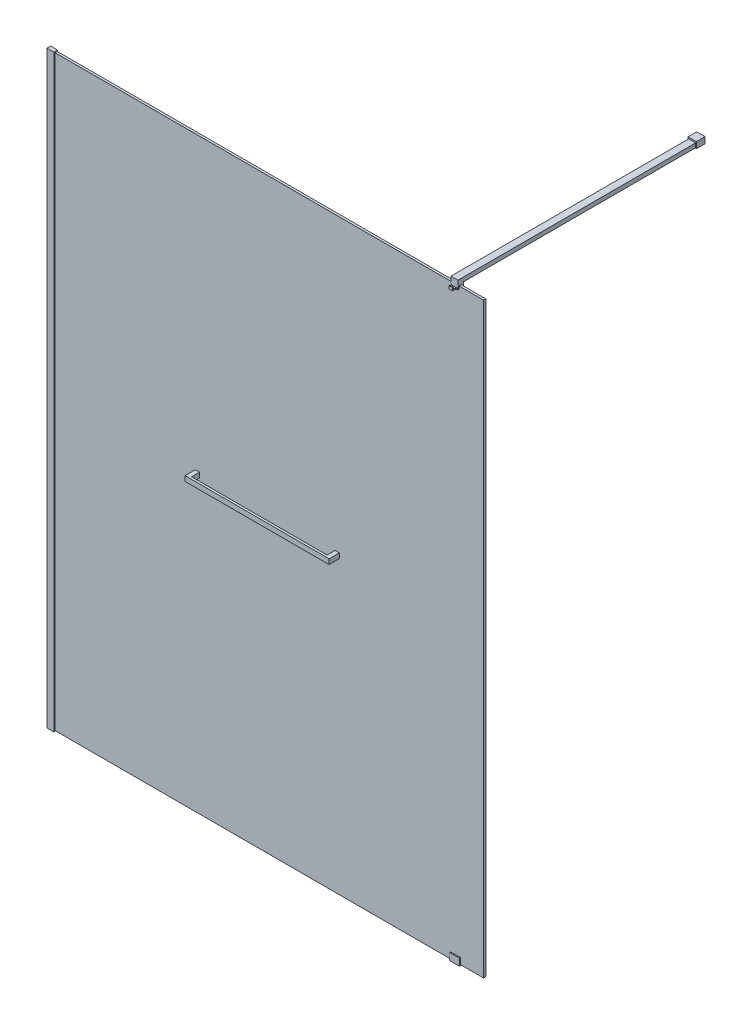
from build123d import *

# Parameters (mm, degrees)
DODANIE_WYCI_GNI_CIE1_DEPTH     = 2100
SZKIC2_W                        = 1547
SZKIC2_H                        = 8
DODANIE_WYCI_GNI_CIE2_DEPTH     = 2100
SZKIC4_W                        = 25
SZKIC4_H                        = 13.3
DODANIE_WYCI_GNI_CIE3_DEPTH     = 3
SZKIC5_W                        = 25
SZKIC5_H                        = 13.3
DODANIE_WYCI_GNI_CIE4_DEPTH     = 3
DODANIE_WYCI_GNI_CIE5_DEPTH     = 17.5
DODANIE_WYCI_GNI_CIE6_DEPTH     = 12.5
WYTNIJ_WYCI_GNI_CIE1_DEPTH      = 2618.585101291
WYTNIJ_WYCI_GNI_CIE1_DEPTH_BACK = 2618.585101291
SZKIC10_W                       = 25
SZKIC10_H                       = 861.63
DODANIE_WYCI_GNI_CIE7_DEPTH     = 15
SZKIC14_W                       = 30
SZKIC14_H                       = 22
DODANIE_WYCI_GNI_CIE8_DEPTH     = 31
POLKA_1A_DEPTH                  = 36.5
POLKA_1A_DEPTH_BACK             = 31
SZKIC17_W                       = 15
SZKIC17_H                       = 18
POLKA_1A_2_DEPTH                = 36.5
POLKA_1A_2_DEPTH_BACK           = 31
POLKA_1B_START                  = -515
SZKIC18_W                       = 12.8
SZKIC18_H                       = 8
POLKA_1B_DEPTH                  = 515
POLKA_1C_START                  = -5.28
SZKIC19_W                       = 515
SZKIC19_H                       = 80
POLKA_1C_DEPTH                  = 8
SZKIC20_W                       = 8
SZKIC20_H                       = 18
POLKA_1D_DEPTH                  = 485


with BuildPart() as part:
    # Szkic1 → Dodanie-wyci_gni_cie1 (new body)
    with BuildSketch(Plane(origin=(0, 0, 0), x_dir=(1, 0, 0), z_dir=(0, 1, 0))):
        Polygon((0, 0), (0, 13.3), (25, 13.3), (25, 11.4), (11.45, 11.4), (11.45, 3.4), (25, 3.4), (25, 0), align=None)
    extrude(amount=DODANIE_WYCI_GNI_CIE1_DEPTH)

    # Szkic4 → Dodanie-wyci_gni_cie3 (add)
    with BuildSketch(Plane(origin=(0, 2100, 0), x_dir=(1, 0, 0), z_dir=(0, 1, 0))):
        with Locations((12.5, 6.65)):
            Rectangle(SZKIC4_W, SZKIC4_H)
    extrude(amount=DODANIE_WYCI_GNI_CIE3_DEPTH)

    # Szkic5 → Dodanie-wyci_gni_cie4 (add)
    with BuildSketch(Plane.XZ):
        with Locations((12.5, -6.65)):
            Rectangle(SZKIC5_W, SZKIC5_H)
    extrude(amount=DODANIE_WYCI_GNI_CIE4_DEPTH)


with BuildPart() as body_2:
    # Szkic2 → Dodanie-wyci_gni_cie2 (new body)
    with BuildSketch(Plane.XZ):
        with Locations((784.95, -7.4)):
            Rectangle(SZKIC2_W, SZKIC2_H)
    extrude(amount=-DODANIE_WYCI_GNI_CIE2_DEPTH)


with BuildPart() as body_3:
    # Szkic6 → Dodanie-wyci_gni_cie5 (new, symmetric)
    with BuildSketch(Plane(origin=(1458.45, 0, 0), x_dir=(0, 0, -1), z_dir=(1, 0, 0))):
        Polygon((11.4, 22), (15.75, 22), (15.75, -3), (-0.35, -3), (-0.35, 22), (3.4, 22), (3.4, 0), (11.4, 0), align=None)
    extrude(amount=DODANIE_WYCI_GNI_CIE5_DEPTH, both=True)


with BuildPart() as body_4:
    # Szkic7 → Dodanie-wyci_gni_cie6 (new, symmetric)
    with BuildSketch(Plane(origin=(1458.45, 0, 0), x_dir=(0, 0, -1), z_dir=(1, 0, 0))):
        Polygon((-0.6, 2120), (19.4, 2120), (19.4, 2090), (11.4, 2090), (11.4, 2100), (3.4, 2100), (3.4, 2090), (-13.37, 2090), (-13.37, 2100), (-10.37, 2100), (-9.845068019, 2094), (-0.6, 2094), align=None)
    extrude(amount=DODANIE_WYCI_GNI_CIE6_DEPTH, both=True)

    # Szkic8 → Wytnij-wyci_gni_cie1 (cut, two sides: drawn at the far end of the back side and taken through both)
    with BuildSketch(Plane(origin=(0, 2100, 0), x_dir=(1, 0, 0), z_dir=(0, 1, 0)).offset(-WYTNIJ_WYCI_GNI_CIE1_DEPTH_BACK)):
        Polygon((-1229.626400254, 1247.041765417), (1445.95, -0.6), (1452.45, -3.630999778), (1452.45, -13.37), (1464.45, -13.37), (1464.45, -3.630999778), (1470.95, -0.6), (4146.526400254, 1247.041765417), (4146.526400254, -4657.302075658), (-1229.626400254, -4657.302075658), align=None)
    extrude(amount=WYTNIJ_WYCI_GNI_CIE1_DEPTH + WYTNIJ_WYCI_GNI_CIE1_DEPTH_BACK, mode=Mode.SUBTRACT)

    # Szkic10 → Dodanie-wyci_gni_cie7 (add)
    with BuildSketch(Plane(origin=(0, 2120, 0), x_dir=(1, 0, 0), z_dir=(0, 1, 0))):
        with Locations((1458.45, 450.215)):
            Rectangle(SZKIC10_W, SZKIC10_H)
    extrude(amount=-DODANIE_WYCI_GNI_CIE7_DEPTH)

    # Szkic14 → Dodanie-wyci_gni_cie8 (add)
    with BuildSketch(Plane(origin=(0, 0, -881.03), x_dir=(-1, 0, 0), z_dir=(0, 0, -1))):
        with Locations((-1458.45, 2114)):
            Rectangle(SZKIC14_W, SZKIC14_H)
    extrude(amount=-DODANIE_WYCI_GNI_CIE8_DEPTH)


with BuildPart() as body_5:
    # Szkic17 → polka_1a (new, two sides: drawn at the far end of the back side and taken through both)
    with BuildSketch(Plane.XY.offset(-3.4).offset(-POLKA_1A_DEPTH_BACK)):
        with Locations((534.95, 1050)):
            Rectangle(SZKIC17_W, SZKIC17_H)
    extrude(amount=POLKA_1A_DEPTH + POLKA_1A_DEPTH_BACK)


with BuildPart() as body_6:
    # Szkic17 → polka_1a 2 (new, two sides: drawn at the far end of the back side and taken through both)
    with BuildSketch(Plane.XY.offset(-3.4).offset(-POLKA_1A_2_DEPTH_BACK)):
        with Locations((1034.95, 1050)):
            Rectangle(SZKIC17_W, SZKIC17_H)
    extrude(amount=POLKA_1A_2_DEPTH + POLKA_1A_2_DEPTH_BACK)


with BuildPart() as polka_1b_tool:
    # Szkic18 → polka_1b (new body)
    with BuildSketch(Plane.ZY.offset(-527.45).offset(POLKA_1B_START)):
        with Locations((-28, 1049.73)):
            Rectangle(SZKIC18_W, SZKIC18_H)
    extrude(amount=POLKA_1B_DEPTH)


with BuildPart() as body_5_1:
    add(body_5.part)

    # polka_1b: cut by polka_1b_tool
    add(polka_1b_tool.part, mode=Mode.SUBTRACT)



with BuildPart() as body_6_1:
    add(body_6.part)

    # polka_1b: cut by polka_1b_tool
    add(polka_1b_tool.part, mode=Mode.SUBTRACT)


with BuildPart() as body_7:
    # Szkic19 → polka_1c (new body)
    with BuildSketch(Plane(origin=(0, 1059, 0), x_dir=(1, 0, 0), z_dir=(0, 1, 0)).offset(POLKA_1C_START)):
        with Locations((784.95, 61.6)):
            Rectangle(SZKIC19_W, SZKIC19_H)
    extrude(amount=-POLKA_1C_DEPTH)


with BuildPart() as body_5_2:
    add(body_5_1.part)

    add(body_6_1.part)  # polka_1d merges body 6
    # Szkic20 → polka_1d (add)
    with BuildSketch(Plane(origin=(542.45, 0, 0), x_dir=(0, 0, -1), z_dir=(1, 0, 0))):
        with Locations((-29.1, 1050)):
            Rectangle(SZKIC20_W, SZKIC20_H)
    extrude(amount=POLKA_1D_DEPTH)


solid = Compound([part.part, body_2.part, body_3.part, body_4.part, body_7.part, body_5_2.part])
